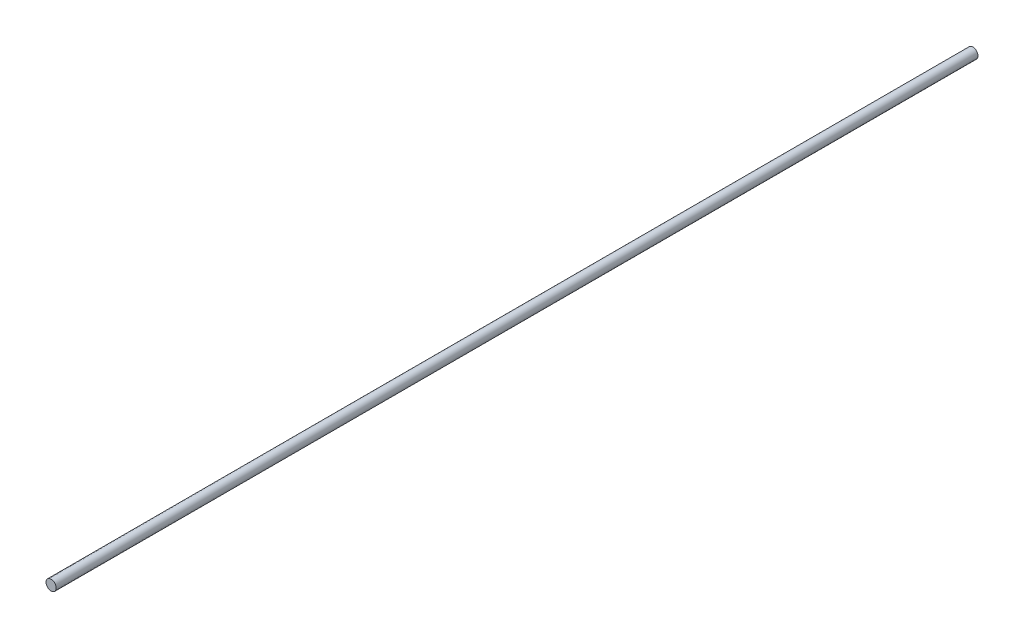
ISO-10303-21;
HEADER;
FILE_DESCRIPTION(('STEP AP214'),'2;1');
FILE_NAME('part.step','',(''),(''),'','','');
FILE_SCHEMA(('AUTOMOTIVE_DESIGN { 1 0 10303 214 1 1 1 1 }'));
ENDSEC;
DATA;
#1=APPLICATION_CONTEXT('core data for automotive mechanical design processes');
#2=APPLICATION_PROTOCOL_DEFINITION('international standard','automotive_design',2000,#1);
#3=PRODUCT_CONTEXT('',#1,'mechanical');
#4=PRODUCT('Part','Part','',(#3));
#5=PRODUCT_RELATED_PRODUCT_CATEGORY('part','',(#4));
#6=PRODUCT_DEFINITION_FORMATION('','',#4);
#7=PRODUCT_DEFINITION_CONTEXT('part definition',#1,'design');
#8=PRODUCT_DEFINITION('design','',#6,#7);
#9=PRODUCT_DEFINITION_SHAPE('','',#8);
#10=(LENGTH_UNIT() NAMED_UNIT(*) SI_UNIT(.MILLI.,.METRE.));
#11=(NAMED_UNIT(*) PLANE_ANGLE_UNIT() SI_UNIT($,.RADIAN.));
#12=(NAMED_UNIT(*) SI_UNIT($,.STERADIAN.) SOLID_ANGLE_UNIT());
#13=UNCERTAINTY_MEASURE_WITH_UNIT(LENGTH_MEASURE(1.E-05),#10,'distance_accuracy_value','');
#14=(GEOMETRIC_REPRESENTATION_CONTEXT(3) GLOBAL_UNCERTAINTY_ASSIGNED_CONTEXT((#13)) GLOBAL_UNIT_ASSIGNED_CONTEXT((#10,
#11,#12)) REPRESENTATION_CONTEXT('',''));
#15=CARTESIAN_POINT('',(0.,0.,0.));
#16=DIRECTION('',(0.,0.,1.));
#17=DIRECTION('',(1.,0.,0.));
#18=AXIS2_PLACEMENT_3D('',#15,#16,#17);
#19=CARTESIAN_POINT('',(0.,0.,-5400.));
#20=DIRECTION('',(0.,0.,1.));
#21=DIRECTION('',(1.,0.,0.));
#22=AXIS2_PLACEMENT_3D('',#19,#20,#21);
#23=CYLINDRICAL_SURFACE('',#22,30.);
#24=CARTESIAN_POINT('',(0.,0.,-5400.));
#25=DIRECTION('',(0.,0.,1.));
#26=DIRECTION('',(1.,0.,0.));
#27=AXIS2_PLACEMENT_3D('',#24,#25,#26);
#28=CIRCLE('',#27,30.);
#29=CARTESIAN_POINT('',(30.,0.,-5400.));
#30=VERTEX_POINT('',#29);
#31=EDGE_CURVE('E10',#30,#30,#28,.T.);
#32=ORIENTED_EDGE('',*,*,#31,.T.);
#33=EDGE_LOOP('',(#32));
#34=FACE_BOUND('',#33,.T.);
#35=CARTESIAN_POINT('',(0.,0.,0.));
#36=DIRECTION('',(0.,0.,1.));
#37=DIRECTION('',(1.,0.,0.));
#38=AXIS2_PLACEMENT_3D('',#35,#36,#37);
#39=CIRCLE('',#38,30.);
#40=CARTESIAN_POINT('',(30.,0.,0.));
#41=VERTEX_POINT('',#40);
#42=EDGE_CURVE('E40',#41,#41,#39,.T.);
#43=ORIENTED_EDGE('',*,*,#42,.F.);
#44=EDGE_LOOP('',(#43));
#45=FACE_BOUND('',#44,.T.);
#46=ADVANCED_FACE('F37',(#34,#45),#23,.T.);
#47=CARTESIAN_POINT('',(0.,0.,-5400.));
#48=DIRECTION('',(0.,0.,1.));
#49=DIRECTION('',(1.,0.,0.));
#50=AXIS2_PLACEMENT_3D('',#47,#48,#49);
#51=PLANE('',#50);
#52=ORIENTED_EDGE('',*,*,#31,.F.);
#53=EDGE_LOOP('',(#52));
#54=FACE_BOUND('',#53,.T.);
#55=ADVANCED_FACE('F54',(#54),#51,.F.);
#56=CARTESIAN_POINT('',(0.,0.,0.));
#57=DIRECTION('',(0.,0.,1.));
#58=DIRECTION('',(1.,0.,0.));
#59=AXIS2_PLACEMENT_3D('',#56,#57,#58);
#60=PLANE('',#59);
#61=ORIENTED_EDGE('',*,*,#42,.T.);
#62=EDGE_LOOP('',(#61));
#63=FACE_BOUND('',#62,.T.);
#64=ADVANCED_FACE('F51',(#63),#60,.T.);
#65=CLOSED_SHELL('',(#46,#55,#64));
#66=MANIFOLD_SOLID_BREP('B2',#65);
#67=ADVANCED_BREP_SHAPE_REPRESENTATION('',(#18,#66),#14);
#68=SHAPE_DEFINITION_REPRESENTATION(#9,#67);
ENDSEC;
END-ISO-10303-21;
